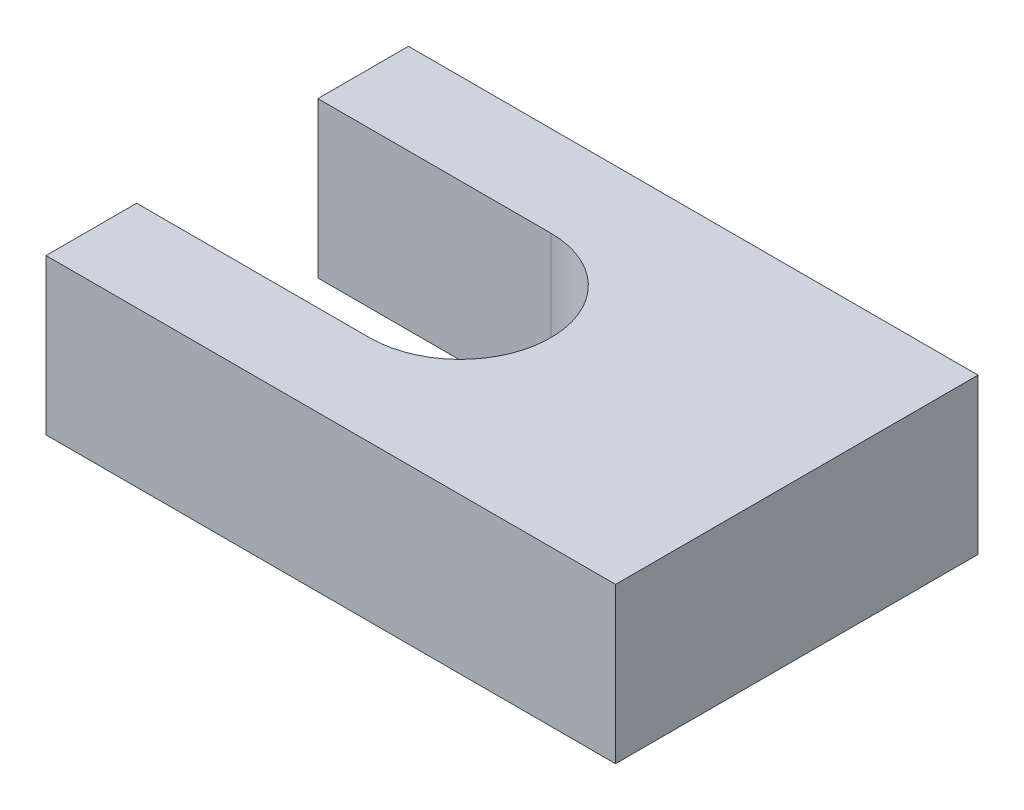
from build123d import *

# Parameters (mm, degrees)
EXTRUDE1_DEPTH = 30


with BuildPart() as part:
    # Sketch1 → Extrude1 (new body)
    with BuildSketch(Plane(origin=(0, 0, 0), x_dir=(1, 0, 0), z_dir=(0, 1, 0))):
        with BuildLine():
            Line((0, 17.5), (-45, 17.5))
            Line((-45, 17.5), (-45, 35))
            Line((-45, 35), (65, 35))
            Line((65, 35), (65, -35))
            Line((65, -35), (-45, -35))
            Line((-45, -35), (-45, -17.5))
            Line((-45, -17.5), (0, -17.5))
            ThreePointArc((0, -17.5), (17.5, 0), (0, 17.5))
        make_face()
    extrude(amount=EXTRUDE1_DEPTH)


solid = part.part
